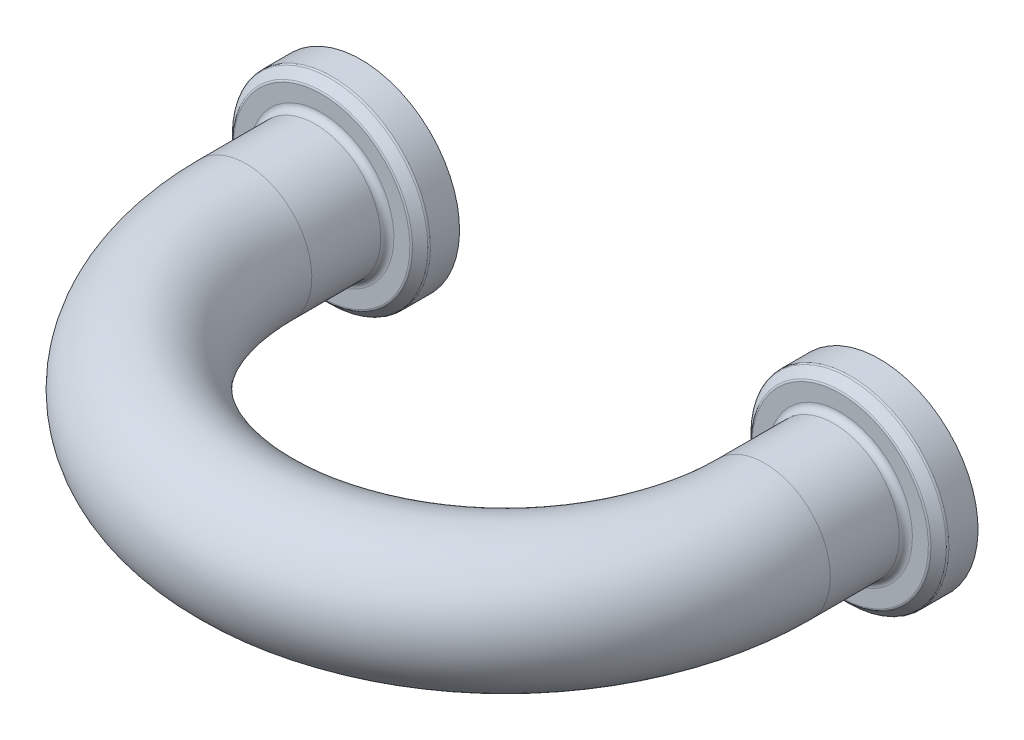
ISO-10303-21;
HEADER;
FILE_DESCRIPTION(('STEP AP214'),'2;1');
FILE_NAME('part.step','',(''),(''),'','','');
FILE_SCHEMA(('AUTOMOTIVE_DESIGN { 1 0 10303 214 1 1 1 1 }'));
ENDSEC;
DATA;
#1=APPLICATION_CONTEXT('core data for automotive mechanical design processes');
#2=APPLICATION_PROTOCOL_DEFINITION('international standard','automotive_design',2000,#1);
#3=PRODUCT_CONTEXT('',#1,'mechanical');
#4=PRODUCT('Part','Part','',(#3));
#5=PRODUCT_RELATED_PRODUCT_CATEGORY('part','',(#4));
#6=PRODUCT_DEFINITION_FORMATION('','',#4);
#7=PRODUCT_DEFINITION_CONTEXT('part definition',#1,'design');
#8=PRODUCT_DEFINITION('design','',#6,#7);
#9=PRODUCT_DEFINITION_SHAPE('','',#8);
#10=(LENGTH_UNIT() NAMED_UNIT(*) SI_UNIT(.MILLI.,.METRE.));
#11=(NAMED_UNIT(*) PLANE_ANGLE_UNIT() SI_UNIT($,.RADIAN.));
#12=(NAMED_UNIT(*) SI_UNIT($,.STERADIAN.) SOLID_ANGLE_UNIT());
#13=UNCERTAINTY_MEASURE_WITH_UNIT(LENGTH_MEASURE(1.E-05),#10,'distance_accuracy_value','');
#14=(GEOMETRIC_REPRESENTATION_CONTEXT(3) GLOBAL_UNCERTAINTY_ASSIGNED_CONTEXT((#13)) GLOBAL_UNIT_ASSIGNED_CONTEXT((#10,
#11,#12)) REPRESENTATION_CONTEXT('',''));
#15=CARTESIAN_POINT('',(0.,0.,0.));
#16=DIRECTION('',(0.,0.,1.));
#17=DIRECTION('',(1.,0.,0.));
#18=AXIS2_PLACEMENT_3D('',#15,#16,#17);
#19=CARTESIAN_POINT('',(19.75,0.,8.75));
#20=DIRECTION('',(0.,1.,0.));
#21=DIRECTION('',(-1.,0.,0.));
#22=AXIS2_PLACEMENT_3D('',#19,#20,#21);
#23=TOROIDAL_SURFACE('',#22,19.75,5.);
#24=CARTESIAN_POINT('',(0.,0.,8.75));
#25=DIRECTION('',(0.,0.,1.));
#26=DIRECTION('',(0.,1.,0.));
#27=AXIS2_PLACEMENT_3D('',#24,#25,#26);
#28=CIRCLE('',#27,5.);
#29=CARTESIAN_POINT('',(-5.,0.,8.75));
#30=VERTEX_POINT('',#29);
#31=EDGE_CURVE('E22',#30,#30,#28,.T.);
#32=CARTESIAN_POINT('',(39.5,0.,8.75));
#33=DIRECTION('',(0.,0.,-1.));
#34=DIRECTION('',(0.,1.,0.));
#35=AXIS2_PLACEMENT_3D('',#32,#33,#34);
#36=CIRCLE('',#35,5.);
#37=CARTESIAN_POINT('',(44.5,0.,8.75));
#38=VERTEX_POINT('',#37);
#39=EDGE_CURVE('E26',#38,#38,#36,.T.);
#40=CARTESIAN_POINT('',(19.75,0.,8.75));
#41=DIRECTION('',(0.,1.,0.));
#42=DIRECTION('',(-1.,0.,0.));
#43=AXIS2_PLACEMENT_3D('',#40,#41,#42);
#44=CIRCLE('',#43,24.75);
#45=EDGE_CURVE('',#30,#38,#44,.T.);
#46=ORIENTED_EDGE('',*,*,#31,.T.);
#47=ORIENTED_EDGE('',*,*,#39,.F.);
#48=ORIENTED_EDGE('',*,*,#45,.T.);
#49=ORIENTED_EDGE('',*,*,#45,.F.);
#50=EDGE_LOOP('',(#46,#48,#47,#49));
#51=FACE_BOUND('',#50,.T.);
#52=ADVANCED_FACE('F12',(#51),#23,.T.);
#53=CARTESIAN_POINT('',(0.,0.,0.));
#54=DIRECTION('',(0.,0.,1.));
#55=DIRECTION('',(0.,-1.,0.));
#56=AXIS2_PLACEMENT_3D('',#53,#54,#55);
#57=PLANE('',#56);
#58=CARTESIAN_POINT('',(0.,0.,0.));
#59=DIRECTION('',(0.,0.,1.));
#60=DIRECTION('',(0.,-1.,0.));
#61=AXIS2_PLACEMENT_3D('',#58,#59,#60);
#62=CIRCLE('',#61,7.5);
#63=CARTESIAN_POINT('',(0.,-7.5,0.));
#64=VERTEX_POINT('',#63);
#65=EDGE_CURVE('E31',#64,#64,#62,.T.);
#66=ORIENTED_EDGE('',*,*,#65,.F.);
#67=EDGE_LOOP('',(#66));
#68=FACE_BOUND('',#67,.T.);
#69=CARTESIAN_POINT('',(0.,0.,0.));
#70=DIRECTION('',(0.,0.,1.));
#71=DIRECTION('',(0.,-1.,0.));
#72=AXIS2_PLACEMENT_3D('',#69,#70,#71);
#73=CIRCLE('',#72,1.75);
#74=CARTESIAN_POINT('',(0.,-1.75,0.));
#75=VERTEX_POINT('',#74);
#76=EDGE_CURVE('E18',#75,#75,#73,.F.);
#77=ORIENTED_EDGE('',*,*,#76,.F.);
#78=EDGE_LOOP('',(#77));
#79=FACE_BOUND('',#78,.T.);
#80=ADVANCED_FACE('F92',(#68,#79),#57,.F.);
#81=CARTESIAN_POINT('',(0.,0.,8.75));
#82=DIRECTION('',(0.,0.,1.));
#83=DIRECTION('',(0.,-1.,0.));
#84=AXIS2_PLACEMENT_3D('',#81,#82,#83);
#85=CYLINDRICAL_SURFACE('',#84,7.5);
#86=CARTESIAN_POINT('',(0.,0.,2.21715728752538));
#87=DIRECTION('',(0.,0.,1.));
#88=DIRECTION('',(0.,-1.,0.));
#89=AXIS2_PLACEMENT_3D('',#86,#87,#88);
#90=CIRCLE('',#89,7.5);
#91=CARTESIAN_POINT('',(0.,-7.5,2.21715728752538));
#92=VERTEX_POINT('',#91);
#93=EDGE_CURVE('E34',#92,#92,#90,.T.);
#94=ORIENTED_EDGE('',*,*,#93,.F.);
#95=EDGE_LOOP('',(#94));
#96=FACE_BOUND('',#95,.T.);
#97=ORIENTED_EDGE('',*,*,#65,.T.);
#98=EDGE_LOOP('',(#97));
#99=FACE_BOUND('',#98,.T.);
#100=ADVANCED_FACE('F97',(#96,#99),#85,.T.);
#101=CARTESIAN_POINT('',(0.,0.,2.21715728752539));
#102=DIRECTION('',(0.,0.,1.));
#103=DIRECTION('',(0.,-1.,0.));
#104=AXIS2_PLACEMENT_3D('',#101,#102,#103);
#105=TOROIDAL_SURFACE('',#104,7.3,0.199999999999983);
#106=ORIENTED_EDGE('',*,*,#93,.T.);
#107=EDGE_LOOP('',(#106));
#108=FACE_BOUND('',#107,.T.);
#109=CARTESIAN_POINT('',(0.,0.,2.35857864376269));
#110=DIRECTION('',(0.,0.,1.));
#111=DIRECTION('',(0.,-1.,0.));
#112=AXIS2_PLACEMENT_3D('',#109,#110,#111);
#113=CIRCLE('',#112,7.44142135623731);
#114=CARTESIAN_POINT('',(0.,-7.44142135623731,2.35857864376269));
#115=VERTEX_POINT('',#114);
#116=EDGE_CURVE('E37',#115,#115,#113,.T.);
#117=ORIENTED_EDGE('',*,*,#116,.F.);
#118=EDGE_LOOP('',(#117));
#119=FACE_BOUND('',#118,.T.);
#120=ADVANCED_FACE('F164',(#108,#119),#105,.T.);
#121=CARTESIAN_POINT('',(0.,0.,2.35857864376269));
#122=DIRECTION('',(0.,0.,-1.));
#123=DIRECTION('',(0.,1.,0.));
#124=AXIS2_PLACEMENT_3D('',#121,#122,#123);
#125=CONICAL_SURFACE('',#124,7.44142135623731,0.785398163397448);
#126=CARTESIAN_POINT('',(0.,0.,2.94142135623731));
#127=DIRECTION('',(0.,0.,1.));
#128=DIRECTION('',(0.,-1.,0.));
#129=AXIS2_PLACEMENT_3D('',#126,#127,#128);
#130=CIRCLE('',#129,6.85857864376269);
#131=CARTESIAN_POINT('',(0.,-6.85857864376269,2.94142135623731));
#132=VERTEX_POINT('',#131);
#133=EDGE_CURVE('E40',#132,#132,#130,.T.);
#134=ORIENTED_EDGE('',*,*,#133,.F.);
#135=EDGE_LOOP('',(#134));
#136=FACE_BOUND('',#135,.T.);
#137=ORIENTED_EDGE('',*,*,#116,.T.);
#138=EDGE_LOOP('',(#137));
#139=FACE_BOUND('',#138,.T.);
#140=ADVANCED_FACE('F160',(#136,#139),#125,.T.);
#141=CARTESIAN_POINT('',(0.,0.,2.8));
#142=DIRECTION('',(0.,0.,1.));
#143=DIRECTION('',(0.,-1.,0.));
#144=AXIS2_PLACEMENT_3D('',#141,#142,#143);
#145=TOROIDAL_SURFACE('',#144,6.71715728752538,0.200000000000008);
#146=ORIENTED_EDGE('',*,*,#133,.T.);
#147=EDGE_LOOP('',(#146));
#148=FACE_BOUND('',#147,.T.);
#149=CARTESIAN_POINT('',(0.,0.,3.));
#150=DIRECTION('',(0.,0.,1.));
#151=DIRECTION('',(0.,-1.,0.));
#152=AXIS2_PLACEMENT_3D('',#149,#150,#151);
#153=CIRCLE('',#152,6.71715728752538);
#154=CARTESIAN_POINT('',(0.,-6.71715728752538,3.));
#155=VERTEX_POINT('',#154);
#156=EDGE_CURVE('E43',#155,#155,#153,.T.);
#157=ORIENTED_EDGE('',*,*,#156,.F.);
#158=EDGE_LOOP('',(#157));
#159=FACE_BOUND('',#158,.T.);
#160=ADVANCED_FACE('F156',(#148,#159),#145,.T.);
#161=CARTESIAN_POINT('',(-6.71715728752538,0.,3.));
#162=DIRECTION('',(0.,0.,-1.));
#163=DIRECTION('',(0.,1.,0.));
#164=AXIS2_PLACEMENT_3D('',#161,#162,#163);
#165=PLANE('',#164);
#166=CARTESIAN_POINT('',(0.,0.,3.));
#167=DIRECTION('',(0.,0.,1.));
#168=DIRECTION('',(0.,-1.,0.));
#169=AXIS2_PLACEMENT_3D('',#166,#167,#168);
#170=CIRCLE('',#169,5.5);
#171=CARTESIAN_POINT('',(0.,-5.5,3.));
#172=VERTEX_POINT('',#171);
#173=EDGE_CURVE('E46',#172,#172,#170,.T.);
#174=ORIENTED_EDGE('',*,*,#173,.F.);
#175=EDGE_LOOP('',(#174));
#176=FACE_BOUND('',#175,.T.);
#177=ORIENTED_EDGE('',*,*,#156,.T.);
#178=EDGE_LOOP('',(#177));
#179=FACE_BOUND('',#178,.T.);
#180=ADVANCED_FACE('F152',(#176,#179),#165,.F.);
#181=CARTESIAN_POINT('',(0.,0.,3.5));
#182=DIRECTION('',(0.,0.,1.));
#183=DIRECTION('',(0.,-1.,0.));
#184=AXIS2_PLACEMENT_3D('',#181,#182,#183);
#185=TOROIDAL_SURFACE('',#184,5.5,0.5);
#186=CARTESIAN_POINT('',(0.,0.,3.5));
#187=DIRECTION('',(0.,0.,1.));
#188=DIRECTION('',(0.,-1.,0.));
#189=AXIS2_PLACEMENT_3D('',#186,#187,#188);
#190=CIRCLE('',#189,5.);
#191=CARTESIAN_POINT('',(0.,-5.,3.5));
#192=VERTEX_POINT('',#191);
#193=EDGE_CURVE('E49',#192,#192,#190,.T.);
#194=ORIENTED_EDGE('',*,*,#193,.F.);
#195=EDGE_LOOP('',(#194));
#196=FACE_BOUND('',#195,.T.);
#197=ORIENTED_EDGE('',*,*,#173,.T.);
#198=EDGE_LOOP('',(#197));
#199=FACE_BOUND('',#198,.T.);
#200=ADVANCED_FACE('F148',(#196,#199),#185,.F.);
#201=CARTESIAN_POINT('',(0.,0.,8.75));
#202=DIRECTION('',(0.,0.,1.));
#203=DIRECTION('',(0.,-1.,0.));
#204=AXIS2_PLACEMENT_3D('',#201,#202,#203);
#205=CYLINDRICAL_SURFACE('',#204,5.);
#206=ORIENTED_EDGE('',*,*,#31,.F.);
#207=EDGE_LOOP('',(#206));
#208=FACE_BOUND('',#207,.T.);
#209=ORIENTED_EDGE('',*,*,#193,.T.);
#210=EDGE_LOOP('',(#209));
#211=FACE_BOUND('',#210,.T.);
#212=ADVANCED_FACE('F144',(#208,#211),#205,.T.);
#213=CARTESIAN_POINT('',(39.5,0.,0.));
#214=DIRECTION('',(0.,0.,1.));
#215=DIRECTION('',(0.,-1.,0.));
#216=AXIS2_PLACEMENT_3D('',#213,#214,#215);
#217=PLANE('',#216);
#218=CARTESIAN_POINT('',(39.5,0.,0.));
#219=DIRECTION('',(0.,0.,1.));
#220=DIRECTION('',(0.,-1.,0.));
#221=AXIS2_PLACEMENT_3D('',#218,#219,#220);
#222=CIRCLE('',#221,7.5);
#223=CARTESIAN_POINT('',(39.5,-7.5,0.));
#224=VERTEX_POINT('',#223);
#225=EDGE_CURVE('E52',#224,#224,#222,.T.);
#226=ORIENTED_EDGE('',*,*,#225,.F.);
#227=EDGE_LOOP('',(#226));
#228=FACE_BOUND('',#227,.T.);
#229=CARTESIAN_POINT('',(39.5,0.,0.));
#230=DIRECTION('',(0.,0.,1.));
#231=DIRECTION('',(0.,-1.,0.));
#232=AXIS2_PLACEMENT_3D('',#229,#230,#231);
#233=CIRCLE('',#232,1.75);
#234=CARTESIAN_POINT('',(39.5,-1.75,0.));
#235=VERTEX_POINT('',#234);
#236=EDGE_CURVE('E8',#235,#235,#233,.F.);
#237=ORIENTED_EDGE('',*,*,#236,.F.);
#238=EDGE_LOOP('',(#237));
#239=FACE_BOUND('',#238,.T.);
#240=ADVANCED_FACE('F140',(#228,#239),#217,.F.);
#241=CARTESIAN_POINT('',(39.5,0.,8.75));
#242=DIRECTION('',(0.,0.,1.));
#243=DIRECTION('',(0.,-1.,0.));
#244=AXIS2_PLACEMENT_3D('',#241,#242,#243);
#245=CYLINDRICAL_SURFACE('',#244,7.5);
#246=CARTESIAN_POINT('',(39.5,0.,2.21715728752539));
#247=DIRECTION('',(0.,0.,1.));
#248=DIRECTION('',(0.,-1.,0.));
#249=AXIS2_PLACEMENT_3D('',#246,#247,#248);
#250=CIRCLE('',#249,7.5);
#251=CARTESIAN_POINT('',(39.5,-7.5,2.21715728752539));
#252=VERTEX_POINT('',#251);
#253=EDGE_CURVE('E55',#252,#252,#250,.T.);
#254=ORIENTED_EDGE('',*,*,#253,.F.);
#255=EDGE_LOOP('',(#254));
#256=FACE_BOUND('',#255,.T.);
#257=ORIENTED_EDGE('',*,*,#225,.T.);
#258=EDGE_LOOP('',(#257));
#259=FACE_BOUND('',#258,.T.);
#260=ADVANCED_FACE('F136',(#256,#259),#245,.T.);
#261=CARTESIAN_POINT('',(39.5,0.,2.2171572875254));
#262=DIRECTION('',(0.,0.,1.));
#263=DIRECTION('',(0.,-1.,0.));
#264=AXIS2_PLACEMENT_3D('',#261,#262,#263);
#265=TOROIDAL_SURFACE('',#264,7.3,0.199999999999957);
#266=ORIENTED_EDGE('',*,*,#253,.T.);
#267=EDGE_LOOP('',(#266));
#268=FACE_BOUND('',#267,.T.);
#269=CARTESIAN_POINT('',(39.5,0.,2.3585786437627));
#270=DIRECTION('',(0.,0.,1.));
#271=DIRECTION('',(0.,-1.,0.));
#272=AXIS2_PLACEMENT_3D('',#269,#270,#271);
#273=CIRCLE('',#272,7.44142135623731);
#274=CARTESIAN_POINT('',(39.5,-7.44142135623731,2.3585786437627));
#275=VERTEX_POINT('',#274);
#276=EDGE_CURVE('E58',#275,#275,#273,.T.);
#277=ORIENTED_EDGE('',*,*,#276,.F.);
#278=EDGE_LOOP('',(#277));
#279=FACE_BOUND('',#278,.T.);
#280=ADVANCED_FACE('F130',(#268,#279),#265,.T.);
#281=CARTESIAN_POINT('',(39.5,0.,2.3585786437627));
#282=DIRECTION('',(0.,0.,-1.));
#283=DIRECTION('',(0.,1.,0.));
#284=AXIS2_PLACEMENT_3D('',#281,#282,#283);
#285=CONICAL_SURFACE('',#284,7.44142135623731,0.785398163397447);
#286=CARTESIAN_POINT('',(39.5,0.,2.94142135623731));
#287=DIRECTION('',(0.,0.,1.));
#288=DIRECTION('',(0.,-1.,0.));
#289=AXIS2_PLACEMENT_3D('',#286,#287,#288);
#290=CIRCLE('',#289,6.85857864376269);
#291=CARTESIAN_POINT('',(39.5,-6.85857864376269,2.94142135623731));
#292=VERTEX_POINT('',#291);
#293=EDGE_CURVE('E61',#292,#292,#290,.T.);
#294=ORIENTED_EDGE('',*,*,#293,.F.);
#295=EDGE_LOOP('',(#294));
#296=FACE_BOUND('',#295,.T.);
#297=ORIENTED_EDGE('',*,*,#276,.T.);
#298=EDGE_LOOP('',(#297));
#299=FACE_BOUND('',#298,.T.);
#300=ADVANCED_FACE('F124',(#296,#299),#285,.T.);
#301=CARTESIAN_POINT('',(39.5,0.,2.79999999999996));
#302=DIRECTION('',(0.,0.,1.));
#303=DIRECTION('',(0.,-1.,0.));
#304=AXIS2_PLACEMENT_3D('',#301,#302,#303);
#305=TOROIDAL_SURFACE('',#304,6.71715728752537,0.200000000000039);
#306=ORIENTED_EDGE('',*,*,#293,.T.);
#307=EDGE_LOOP('',(#306));
#308=FACE_BOUND('',#307,.T.);
#309=CARTESIAN_POINT('',(39.5,0.,3.));
#310=DIRECTION('',(0.,0.,1.));
#311=DIRECTION('',(0.,-1.,0.));
#312=AXIS2_PLACEMENT_3D('',#309,#310,#311);
#313=CIRCLE('',#312,6.71715728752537);
#314=CARTESIAN_POINT('',(39.5,-6.71715728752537,3.));
#315=VERTEX_POINT('',#314);
#316=EDGE_CURVE('E64',#315,#315,#313,.T.);
#317=ORIENTED_EDGE('',*,*,#316,.F.);
#318=EDGE_LOOP('',(#317));
#319=FACE_BOUND('',#318,.T.);
#320=ADVANCED_FACE('F119',(#308,#319),#305,.T.);
#321=CARTESIAN_POINT('',(32.7828427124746,0.,3.));
#322=DIRECTION('',(0.,0.,-1.));
#323=DIRECTION('',(0.,1.,0.));
#324=AXIS2_PLACEMENT_3D('',#321,#322,#323);
#325=PLANE('',#324);
#326=CARTESIAN_POINT('',(39.5,0.,3.));
#327=DIRECTION('',(0.,0.,1.));
#328=DIRECTION('',(0.,-1.,0.));
#329=AXIS2_PLACEMENT_3D('',#326,#327,#328);
#330=CIRCLE('',#329,5.5);
#331=CARTESIAN_POINT('',(39.5,-5.5,3.));
#332=VERTEX_POINT('',#331);
#333=EDGE_CURVE('E67',#332,#332,#330,.T.);
#334=ORIENTED_EDGE('',*,*,#333,.F.);
#335=EDGE_LOOP('',(#334));
#336=FACE_BOUND('',#335,.T.);
#337=ORIENTED_EDGE('',*,*,#316,.T.);
#338=EDGE_LOOP('',(#337));
#339=FACE_BOUND('',#338,.T.);
#340=ADVANCED_FACE('F113',(#336,#339),#325,.F.);
#341=CARTESIAN_POINT('',(39.5,0.,3.5));
#342=DIRECTION('',(0.,0.,1.));
#343=DIRECTION('',(0.,-1.,0.));
#344=AXIS2_PLACEMENT_3D('',#341,#342,#343);
#345=TOROIDAL_SURFACE('',#344,5.5,0.5);
#346=CARTESIAN_POINT('',(39.5,0.,3.5));
#347=DIRECTION('',(0.,0.,1.));
#348=DIRECTION('',(0.,-1.,0.));
#349=AXIS2_PLACEMENT_3D('',#346,#347,#348);
#350=CIRCLE('',#349,5.);
#351=CARTESIAN_POINT('',(39.5,-5.,3.5));
#352=VERTEX_POINT('',#351);
#353=EDGE_CURVE('E70',#352,#352,#350,.T.);
#354=ORIENTED_EDGE('',*,*,#353,.F.);
#355=EDGE_LOOP('',(#354));
#356=FACE_BOUND('',#355,.T.);
#357=ORIENTED_EDGE('',*,*,#333,.T.);
#358=EDGE_LOOP('',(#357));
#359=FACE_BOUND('',#358,.T.);
#360=ADVANCED_FACE('F107',(#356,#359),#345,.F.);
#361=CARTESIAN_POINT('',(39.5,0.,8.75));
#362=DIRECTION('',(0.,0.,1.));
#363=DIRECTION('',(0.,-1.,0.));
#364=AXIS2_PLACEMENT_3D('',#361,#362,#363);
#365=CYLINDRICAL_SURFACE('',#364,5.);
#366=ORIENTED_EDGE('',*,*,#39,.T.);
#367=EDGE_LOOP('',(#366));
#368=FACE_BOUND('',#367,.T.);
#369=ORIENTED_EDGE('',*,*,#353,.T.);
#370=EDGE_LOOP('',(#369));
#371=FACE_BOUND('',#370,.T.);
#372=ADVANCED_FACE('F103',(#368,#371),#365,.T.);
#373=CARTESIAN_POINT('',(0.,0.,14.));
#374=DIRECTION('',(0.,0.,-1.));
#375=DIRECTION('',(0.,1.,0.));
#376=AXIS2_PLACEMENT_3D('',#373,#374,#375);
#377=PLANE('',#376);
#378=CARTESIAN_POINT('',(0.,0.,14.));
#379=DIRECTION('',(0.,0.,-1.));
#380=DIRECTION('',(0.,1.,0.));
#381=AXIS2_PLACEMENT_3D('',#378,#379,#380);
#382=CIRCLE('',#381,1.26110922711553);
#383=CARTESIAN_POINT('',(0.,1.26110922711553,14.));
#384=VERTEX_POINT('',#383);
#385=EDGE_CURVE('E73',#384,#384,#382,.T.);
#386=ORIENTED_EDGE('',*,*,#385,.T.);
#387=EDGE_LOOP('',(#386));
#388=FACE_BOUND('',#387,.T.);
#389=ADVANCED_FACE('F106',(#388),#377,.T.);
#390=CARTESIAN_POINT('',(0.,0.,14.));
#391=DIRECTION('',(0.,0.,-1.));
#392=DIRECTION('',(0.,1.,0.));
#393=AXIS2_PLACEMENT_3D('',#390,#391,#392);
#394=CONICAL_SURFACE('',#393,1.26110922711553,0.0349065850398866);
#395=ORIENTED_EDGE('',*,*,#76,.T.);
#396=EDGE_LOOP('',(#395));
#397=FACE_BOUND('',#396,.T.);
#398=ORIENTED_EDGE('',*,*,#385,.F.);
#399=EDGE_LOOP('',(#398));
#400=FACE_BOUND('',#399,.T.);
#401=ADVANCED_FACE('F89',(#397,#400),#394,.F.);
#402=CARTESIAN_POINT('',(39.5,0.,14.));
#403=DIRECTION('',(0.,0.,-1.));
#404=DIRECTION('',(0.,1.,0.));
#405=AXIS2_PLACEMENT_3D('',#402,#403,#404);
#406=PLANE('',#405);
#407=CARTESIAN_POINT('',(39.5,0.,14.));
#408=DIRECTION('',(0.,0.,-1.));
#409=DIRECTION('',(0.,1.,0.));
#410=AXIS2_PLACEMENT_3D('',#407,#408,#409);
#411=CIRCLE('',#410,1.26110922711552);
#412=CARTESIAN_POINT('',(39.5,1.26110922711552,14.));
#413=VERTEX_POINT('',#412);
#414=EDGE_CURVE('E76',#413,#413,#411,.T.);
#415=ORIENTED_EDGE('',*,*,#414,.T.);
#416=EDGE_LOOP('',(#415));
#417=FACE_BOUND('',#416,.T.);
#418=ADVANCED_FACE('F80',(#417),#406,.T.);
#419=CARTESIAN_POINT('',(39.5,0.,14.));
#420=DIRECTION('',(0.,0.,-1.));
#421=DIRECTION('',(0.,1.,0.));
#422=AXIS2_PLACEMENT_3D('',#419,#420,#421);
#423=CONICAL_SURFACE('',#422,1.26110922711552,0.0349065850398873);
#424=ORIENTED_EDGE('',*,*,#236,.T.);
#425=EDGE_LOOP('',(#424));
#426=FACE_BOUND('',#425,.T.);
#427=ORIENTED_EDGE('',*,*,#414,.F.);
#428=EDGE_LOOP('',(#427));
#429=FACE_BOUND('',#428,.T.);
#430=ADVANCED_FACE('F82',(#426,#429),#423,.F.);
#431=CLOSED_SHELL('',(#52,#80,#100,#120,#140,#160,#180,#200,#212,#240,#260,#280,#300,#320,#340,
#360,#372,#389,#401,#418,#430));
#432=MANIFOLD_SOLID_BREP('B1',#431);
#433=ADVANCED_BREP_SHAPE_REPRESENTATION('',(#18,#432),#14);
#434=SHAPE_DEFINITION_REPRESENTATION(#9,#433);
ENDSEC;
END-ISO-10303-21;
